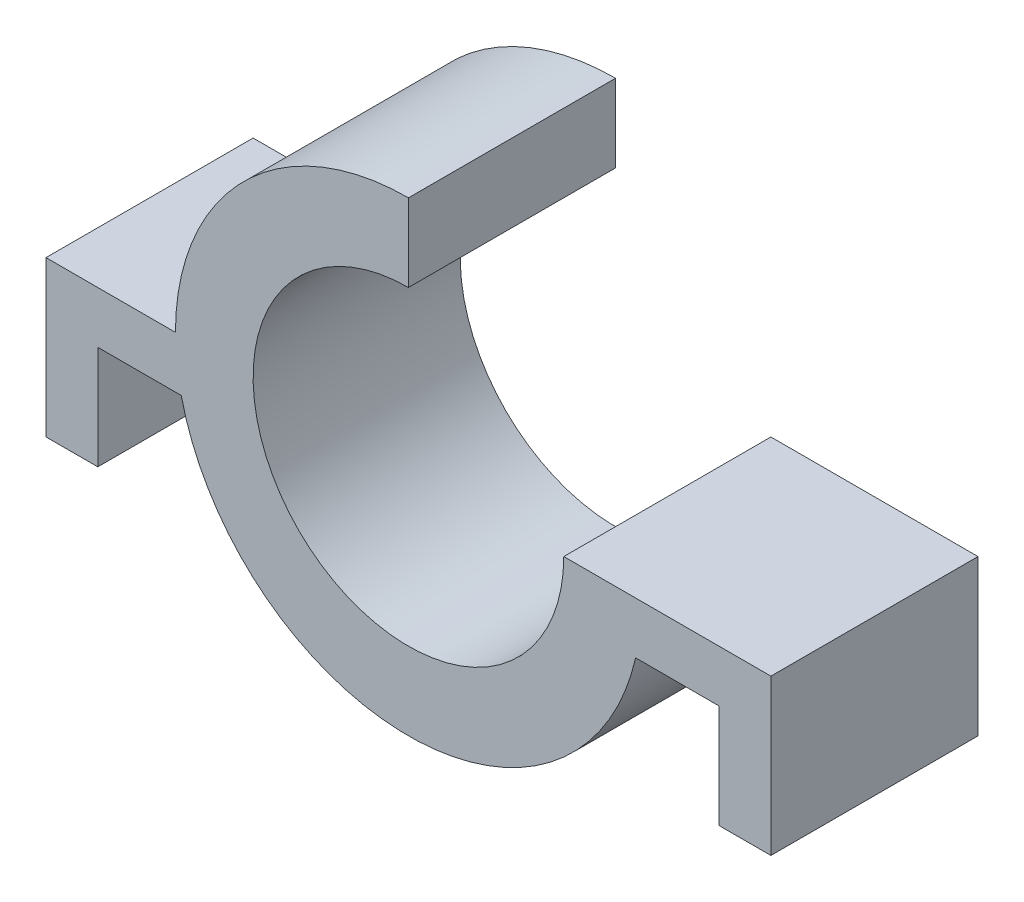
from build123d import *

# Parameters (mm, degrees)
SKETCH_1_R          = 4.5
SKETCH_1_R_2        = 3
EXTRUDE_1_DEPTH     = 4
SKETCH_2_W          = 4.5
SKETCH_2_H          = 4.5
CUT_EXTRUDE_1_DEPTH = 8.516648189
SKETCH_3_W          = 1
SKETCH_3_H          = 2
EXTRUDE_3_DEPTH     = 4
SKETCH_4_W          = 1
SKETCH_4_H          = 2
EXTRUDE_4_DEPTH     = 4


with BuildPart() as part:
    # Sketch 1 → Extrude 1 (new body)
    with BuildSketch(Plane.XY):
        Circle(SKETCH_1_R)
        Circle(SKETCH_1_R_2, mode=Mode.SUBTRACT)
    extrude(amount=EXTRUDE_1_DEPTH)

    # Sketch 2 → Cut-Extrude 1 (cut, through all)
    with BuildSketch(Plane.XY.offset(4)):
        with Locations((2.25, 2.25)):
            Rectangle(SKETCH_2_W, SKETCH_2_H)
    extrude(amount=-CUT_EXTRUDE_1_DEPTH, mode=Mode.SUBTRACT)

    # Sketch 3 → Extrude 3 (add, through all)
    with BuildSketch(Plane.XY.offset(4)):
        with BuildLine():
            Line((7, 0), (4.5, 0))
            ThreePointArc((4.5, 0), (4.471782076, -0.503155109), (4.387482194, -1))
            Line((4.387482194, -1), (6, -1))
            Line((6, -1), (7, -1))
            Line((7, -1), (7, 0))
        make_face()
        with Locations((6.5, -2)):
            Rectangle(SKETCH_3_W, SKETCH_3_H)
    extrude(amount=-EXTRUDE_3_DEPTH)

    # Sketch 4 → Extrude 4 (add, through all)
    with BuildSketch(Plane.XY.offset(4)):
        with BuildLine():
            ThreePointArc((-4.387482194, -1), (-4.471782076, -0.503155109), (-4.5, 0))
            Line((-4.5, 0), (-7, 0))
            Line((-7, 0), (-7, -1))
            Line((-7, -1), (-6, -1))
            Line((-6, -1), (-4.387482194, -1))
        make_face()
        with Locations((-6.5, -2)):
            Rectangle(SKETCH_4_W, SKETCH_4_H)
    extrude(amount=-EXTRUDE_4_DEPTH)


solid = part.part
